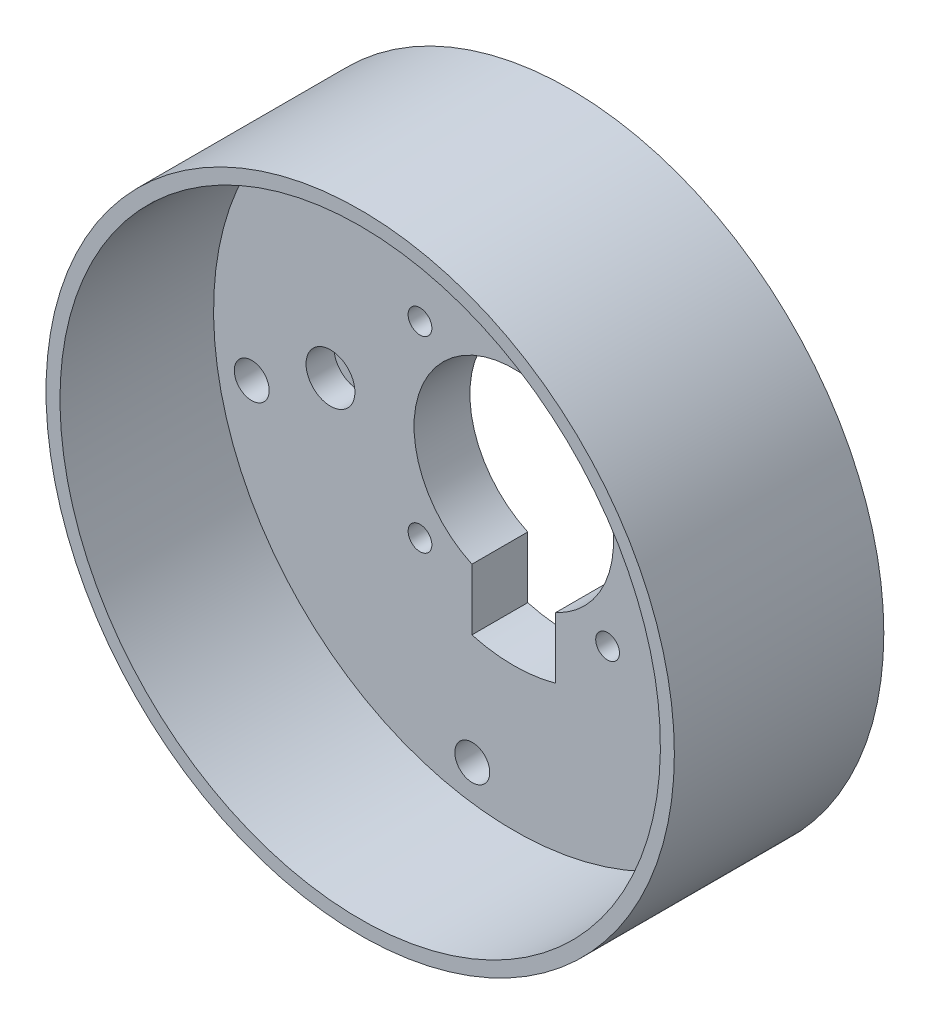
ISO-10303-21;
HEADER;
FILE_DESCRIPTION(('STEP AP214'),'2;1');
FILE_NAME('part.step','',(''),(''),'','','');
FILE_SCHEMA(('AUTOMOTIVE_DESIGN { 1 0 10303 214 1 1 1 1 }'));
ENDSEC;
DATA;
#1=APPLICATION_CONTEXT('core data for automotive mechanical design processes');
#2=APPLICATION_PROTOCOL_DEFINITION('international standard','automotive_design',2000,#1);
#3=PRODUCT_CONTEXT('',#1,'mechanical');
#4=PRODUCT('Part','Part','',(#3));
#5=PRODUCT_RELATED_PRODUCT_CATEGORY('part','',(#4));
#6=PRODUCT_DEFINITION_FORMATION('','',#4);
#7=PRODUCT_DEFINITION_CONTEXT('part definition',#1,'design');
#8=PRODUCT_DEFINITION('design','',#6,#7);
#9=PRODUCT_DEFINITION_SHAPE('','',#8);
#10=(LENGTH_UNIT() NAMED_UNIT(*) SI_UNIT(.MILLI.,.METRE.));
#11=(NAMED_UNIT(*) PLANE_ANGLE_UNIT() SI_UNIT($,.RADIAN.));
#12=(NAMED_UNIT(*) SI_UNIT($,.STERADIAN.) SOLID_ANGLE_UNIT());
#13=UNCERTAINTY_MEASURE_WITH_UNIT(LENGTH_MEASURE(1.E-05),#10,'distance_accuracy_value','');
#14=(GEOMETRIC_REPRESENTATION_CONTEXT(3) GLOBAL_UNCERTAINTY_ASSIGNED_CONTEXT((#13)) GLOBAL_UNIT_ASSIGNED_CONTEXT((#10,
#11,#12)) REPRESENTATION_CONTEXT('',''));
#15=CARTESIAN_POINT('',(0.,0.,0.));
#16=DIRECTION('',(0.,0.,1.));
#17=DIRECTION('',(1.,0.,0.));
#18=AXIS2_PLACEMENT_3D('',#15,#16,#17);
#19=CARTESIAN_POINT('',(0.,0.,8.));
#20=DIRECTION('',(0.,0.,1.));
#21=DIRECTION('',(1.,0.,0.));
#22=AXIS2_PLACEMENT_3D('',#19,#20,#21);
#23=PLANE('',#22);
#24=CARTESIAN_POINT('',(33.8582479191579,-17.251638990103,8.));
#25=DIRECTION('',(0.,0.,-1.));
#26=DIRECTION('',(-1.,0.,0.));
#27=AXIS2_PLACEMENT_3D('',#24,#25,#26);
#28=CIRCLE('',#27,2.5);
#29=CARTESIAN_POINT('',(31.3582479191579,-17.251638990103,8.));
#30=VERTEX_POINT('',#29);
#31=EDGE_CURVE('E216',#30,#30,#28,.T.);
#32=ORIENTED_EDGE('',*,*,#31,.T.);
#33=EDGE_LOOP('',(#32));
#34=FACE_BOUND('',#33,.T.);
#35=CARTESIAN_POINT('',(26.8700576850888,26.8700576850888,8.));
#36=DIRECTION('',(0.,0.,-1.));
#37=DIRECTION('',(-1.,0.,0.));
#38=AXIS2_PLACEMENT_3D('',#35,#36,#37);
#39=CIRCLE('',#38,2.5);
#40=CARTESIAN_POINT('',(24.3700576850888,26.8700576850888,8.));
#41=VERTEX_POINT('',#40);
#42=EDGE_CURVE('E201',#41,#41,#39,.T.);
#43=ORIENTED_EDGE('',*,*,#42,.T.);
#44=EDGE_LOOP('',(#43));
#45=FACE_BOUND('',#44,.T.);
#46=CARTESIAN_POINT('',(-5.94450967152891,-37.5321569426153,8.));
#47=DIRECTION('',(0.,0.,-1.));
#48=DIRECTION('',(-1.,0.,0.));
#49=AXIS2_PLACEMENT_3D('',#46,#47,#48);
#50=CIRCLE('',#49,2.5);
#51=CARTESIAN_POINT('',(-8.44450967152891,-37.5321569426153,8.));
#52=VERTEX_POINT('',#51);
#53=EDGE_CURVE('E197',#52,#52,#50,.T.);
#54=ORIENTED_EDGE('',*,*,#53,.T.);
#55=EDGE_LOOP('',(#54));
#56=FACE_BOUND('',#55,.T.);
#57=CARTESIAN_POINT('',(-17.2516389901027,33.8582479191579,8.));
#58=DIRECTION('',(0.,0.,-1.));
#59=DIRECTION('',(-1.,0.,0.));
#60=AXIS2_PLACEMENT_3D('',#57,#58,#59);
#61=CIRCLE('',#60,2.5);
#62=CARTESIAN_POINT('',(-19.7516389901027,33.8582479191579,8.));
#63=VERTEX_POINT('',#62);
#64=EDGE_CURVE('E193',#63,#63,#61,.T.);
#65=ORIENTED_EDGE('',*,*,#64,.T.);
#66=EDGE_LOOP('',(#65));
#67=FACE_BOUND('',#66,.T.);
#68=CARTESIAN_POINT('',(-37.5321569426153,-5.94450967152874,8.));
#69=DIRECTION('',(0.,0.,-1.));
#70=DIRECTION('',(-1.,0.,0.));
#71=AXIS2_PLACEMENT_3D('',#68,#69,#70);
#72=CIRCLE('',#71,2.5);
#73=CARTESIAN_POINT('',(-40.0321569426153,-5.94450967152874,8.));
#74=VERTEX_POINT('',#73);
#75=EDGE_CURVE('E188',#74,#74,#72,.T.);
#76=ORIENTED_EDGE('',*,*,#75,.T.);
#77=EDGE_LOOP('',(#76));
#78=FACE_BOUND('',#77,.T.);
#79=CARTESIAN_POINT('',(26.25,-1.72017955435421E-13,8.));
#80=DIRECTION('',(0.,0.,-1.));
#81=DIRECTION('',(-1.,0.,0.));
#82=AXIS2_PLACEMENT_3D('',#79,#80,#81);
#83=CIRCLE('',#82,3.5);
#84=CARTESIAN_POINT('',(22.75,-1.72017955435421E-13,8.));
#85=VERTEX_POINT('',#84);
#86=EDGE_CURVE('E187',#85,#85,#83,.T.);
#87=ORIENTED_EDGE('',*,*,#86,.T.);
#88=EDGE_LOOP('',(#87));
#89=FACE_BOUND('',#88,.T.);
#90=CARTESIAN_POINT('',(1.57918123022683E-13,26.2499999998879,8.));
#91=DIRECTION('',(0.,0.,-1.));
#92=DIRECTION('',(-1.,0.,0.));
#93=AXIS2_PLACEMENT_3D('',#90,#91,#92);
#94=CIRCLE('',#93,3.5);
#95=CARTESIAN_POINT('',(-3.49999999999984,26.2499999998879,8.));
#96=VERTEX_POINT('',#95);
#97=EDGE_CURVE('E181',#96,#96,#94,.T.);
#98=ORIENTED_EDGE('',*,*,#97,.T.);
#99=EDGE_LOOP('',(#98));
#100=FACE_BOUND('',#99,.T.);
#101=CARTESIAN_POINT('',(-26.2499999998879,1.26898491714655E-13,8.));
#102=DIRECTION('',(0.,0.,-1.));
#103=DIRECTION('',(-1.,0.,0.));
#104=AXIS2_PLACEMENT_3D('',#101,#102,#103);
#105=CIRCLE('',#104,3.5);
#106=CARTESIAN_POINT('',(-29.7499999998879,1.26898491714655E-13,8.));
#107=VERTEX_POINT('',#106);
#108=EDGE_CURVE('E175',#107,#107,#105,.T.);
#109=ORIENTED_EDGE('',*,*,#108,.T.);
#110=EDGE_LOOP('',(#109));
#111=FACE_BOUND('',#110,.T.);
#112=CARTESIAN_POINT('',(0.,0.,8.));
#113=DIRECTION('',(0.,0.,1.));
#114=DIRECTION('',(1.,0.,0.));
#115=AXIS2_PLACEMENT_3D('',#112,#113,#114);
#116=CIRCLE('',#115,22.55);
#117=CARTESIAN_POINT('',(6.,-21.7371226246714,8.));
#118=VERTEX_POINT('',#117);
#119=CARTESIAN_POINT('',(-6.,-21.7371226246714,8.));
#120=VERTEX_POINT('',#119);
#121=EDGE_CURVE('E70',#118,#120,#116,.F.);
#122=ORIENTED_EDGE('',*,*,#121,.T.);
#123=DIRECTION('',(0.,1.,0.));
#124=VECTOR('',#123,1.);
#125=CARTESIAN_POINT('',(-6.00000000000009,-15.2728456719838,8.));
#126=LINE('',#125,#124);
#127=CARTESIAN_POINT('',(-6.,-12.96659771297,8.));
#128=VERTEX_POINT('',#127);
#129=EDGE_CURVE('E62',#120,#128,#126,.T.);
#130=ORIENTED_EDGE('',*,*,#129,.T.);
#131=CARTESIAN_POINT('',(0.,0.,8.));
#132=DIRECTION('',(0.,0.,1.));
#133=DIRECTION('',(1.,0.,0.));
#134=AXIS2_PLACEMENT_3D('',#131,#132,#133);
#135=CIRCLE('',#134,14.2875);
#136=CARTESIAN_POINT('',(5.99999999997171,-12.9665977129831,8.));
#137=VERTEX_POINT('',#136);
#138=EDGE_CURVE('E11',#137,#128,#135,.T.);
#139=ORIENTED_EDGE('',*,*,#138,.F.);
#140=DIRECTION('',(0.,-1.,0.));
#141=VECTOR('',#140,1.);
#142=CARTESIAN_POINT('',(6.,-15.272845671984,8.));
#143=LINE('',#142,#141);
#144=EDGE_CURVE('E78',#137,#118,#143,.T.);
#145=ORIENTED_EDGE('',*,*,#144,.T.);
#146=EDGE_LOOP('',(#122,#130,#139,#145));
#147=FACE_BOUND('',#146,.T.);
#148=CARTESIAN_POINT('',(-13.4350288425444,-13.4350288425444,8.));
#149=DIRECTION('',(0.,0.,1.));
#150=DIRECTION('',(1.,0.,0.));
#151=AXIS2_PLACEMENT_3D('',#148,#149,#150);
#152=CIRCLE('',#151,1.7);
#153=CARTESIAN_POINT('',(-11.7350288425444,-13.4350288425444,8.));
#154=VERTEX_POINT('',#153);
#155=EDGE_CURVE('E145',#154,#154,#152,.T.);
#156=ORIENTED_EDGE('',*,*,#155,.F.);
#157=EDGE_LOOP('',(#156));
#158=FACE_BOUND('',#157,.T.);
#159=CARTESIAN_POINT('',(-13.4350288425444,13.4350288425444,8.));
#160=DIRECTION('',(0.,0.,1.));
#161=DIRECTION('',(1.,0.,0.));
#162=AXIS2_PLACEMENT_3D('',#159,#160,#161);
#163=CIRCLE('',#162,1.7);
#164=CARTESIAN_POINT('',(-11.7350288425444,13.4350288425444,8.));
#165=VERTEX_POINT('',#164);
#166=EDGE_CURVE('E133',#165,#165,#163,.T.);
#167=ORIENTED_EDGE('',*,*,#166,.F.);
#168=EDGE_LOOP('',(#167));
#169=FACE_BOUND('',#168,.T.);
#170=CARTESIAN_POINT('',(13.4350288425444,-13.4350288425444,8.));
#171=DIRECTION('',(0.,0.,1.));
#172=DIRECTION('',(1.,0.,0.));
#173=AXIS2_PLACEMENT_3D('',#170,#171,#172);
#174=CIRCLE('',#173,1.7);
#175=CARTESIAN_POINT('',(15.1350288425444,-13.4350288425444,8.));
#176=VERTEX_POINT('',#175);
#177=EDGE_CURVE('E120',#176,#176,#174,.T.);
#178=ORIENTED_EDGE('',*,*,#177,.F.);
#179=EDGE_LOOP('',(#178));
#180=FACE_BOUND('',#179,.T.);
#181=CARTESIAN_POINT('',(13.4350288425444,13.4350288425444,8.));
#182=DIRECTION('',(0.,0.,1.));
#183=DIRECTION('',(1.,0.,0.));
#184=AXIS2_PLACEMENT_3D('',#181,#182,#183);
#185=CIRCLE('',#184,1.7);
#186=CARTESIAN_POINT('',(15.1350288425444,13.4350288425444,8.));
#187=VERTEX_POINT('',#186);
#188=EDGE_CURVE('E107',#187,#187,#185,.T.);
#189=ORIENTED_EDGE('',*,*,#188,.F.);
#190=EDGE_LOOP('',(#189));
#191=FACE_BOUND('',#190,.T.);
#192=CARTESIAN_POINT('',(0.,0.,8.));
#193=DIRECTION('',(0.,0.,1.));
#194=DIRECTION('',(0.,1.,0.));
#195=AXIS2_PLACEMENT_3D('',#192,#193,#194);
#196=CIRCLE('',#195,43.);
#197=CARTESIAN_POINT('',(0.,43.,8.));
#198=VERTEX_POINT('',#197);
#199=EDGE_CURVE('E169',#198,#198,#196,.T.);
#200=ORIENTED_EDGE('',*,*,#199,.T.);
#201=EDGE_LOOP('',(#200));
#202=FACE_BOUND('',#201,.T.);
#203=ADVANCED_FACE('F17',(#34,#45,#56,#67,#78,#89,#100,#111,#147,#158,#169,#180,#191,#202),#23,.T.);
#204=CARTESIAN_POINT('',(0.,0.,0.));
#205=DIRECTION('',(0.,0.,1.));
#206=DIRECTION('',(1.,0.,0.));
#207=AXIS2_PLACEMENT_3D('',#204,#205,#206);
#208=PLANE('',#207);
#209=CARTESIAN_POINT('',(33.8582479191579,-17.251638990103,0.));
#210=DIRECTION('',(0.,0.,1.));
#211=DIRECTION('',(1.,0.,0.));
#212=AXIS2_PLACEMENT_3D('',#209,#210,#211);
#213=CIRCLE('',#212,2.5);
#214=CARTESIAN_POINT('',(36.3582479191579,-17.251638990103,0.));
#215=VERTEX_POINT('',#214);
#216=EDGE_CURVE('E21',#215,#215,#213,.T.);
#217=ORIENTED_EDGE('',*,*,#216,.T.);
#218=EDGE_LOOP('',(#217));
#219=FACE_BOUND('',#218,.T.);
#220=CARTESIAN_POINT('',(26.8700576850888,26.8700576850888,0.));
#221=DIRECTION('',(0.,0.,1.));
#222=DIRECTION('',(1.,0.,0.));
#223=AXIS2_PLACEMENT_3D('',#220,#221,#222);
#224=CIRCLE('',#223,2.5);
#225=CARTESIAN_POINT('',(29.3700576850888,26.8700576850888,0.));
#226=VERTEX_POINT('',#225);
#227=EDGE_CURVE('E198',#226,#226,#224,.T.);
#228=ORIENTED_EDGE('',*,*,#227,.T.);
#229=EDGE_LOOP('',(#228));
#230=FACE_BOUND('',#229,.T.);
#231=CARTESIAN_POINT('',(-5.94450967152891,-37.5321569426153,0.));
#232=DIRECTION('',(0.,0.,1.));
#233=DIRECTION('',(1.,0.,0.));
#234=AXIS2_PLACEMENT_3D('',#231,#232,#233);
#235=CIRCLE('',#234,2.5);
#236=CARTESIAN_POINT('',(-3.44450967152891,-37.5321569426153,0.));
#237=VERTEX_POINT('',#236);
#238=EDGE_CURVE('E194',#237,#237,#235,.T.);
#239=ORIENTED_EDGE('',*,*,#238,.T.);
#240=EDGE_LOOP('',(#239));
#241=FACE_BOUND('',#240,.T.);
#242=CARTESIAN_POINT('',(-17.2516389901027,33.8582479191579,0.));
#243=DIRECTION('',(0.,0.,1.));
#244=DIRECTION('',(1.,0.,0.));
#245=AXIS2_PLACEMENT_3D('',#242,#243,#244);
#246=CIRCLE('',#245,2.5);
#247=CARTESIAN_POINT('',(-14.7516389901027,33.8582479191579,0.));
#248=VERTEX_POINT('',#247);
#249=EDGE_CURVE('E189',#248,#248,#246,.T.);
#250=ORIENTED_EDGE('',*,*,#249,.T.);
#251=EDGE_LOOP('',(#250));
#252=FACE_BOUND('',#251,.T.);
#253=CARTESIAN_POINT('',(-37.5321569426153,-5.94450967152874,0.));
#254=DIRECTION('',(0.,0.,1.));
#255=DIRECTION('',(1.,0.,0.));
#256=AXIS2_PLACEMENT_3D('',#253,#254,#255);
#257=CIRCLE('',#256,2.5);
#258=CARTESIAN_POINT('',(-35.0321569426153,-5.94450967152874,0.));
#259=VERTEX_POINT('',#258);
#260=EDGE_CURVE('E183',#259,#259,#257,.T.);
#261=ORIENTED_EDGE('',*,*,#260,.T.);
#262=EDGE_LOOP('',(#261));
#263=FACE_BOUND('',#262,.T.);
#264=CARTESIAN_POINT('',(26.25,-1.72017955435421E-13,0.));
#265=DIRECTION('',(0.,0.,1.));
#266=DIRECTION('',(1.,0.,0.));
#267=AXIS2_PLACEMENT_3D('',#264,#265,#266);
#268=CIRCLE('',#267,1.7);
#269=CARTESIAN_POINT('',(27.95,-1.72017955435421E-13,0.));
#270=VERTEX_POINT('',#269);
#271=EDGE_CURVE('E177',#270,#270,#268,.T.);
#272=ORIENTED_EDGE('',*,*,#271,.T.);
#273=EDGE_LOOP('',(#272));
#274=FACE_BOUND('',#273,.T.);
#275=CARTESIAN_POINT('',(1.57918123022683E-13,26.2499999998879,0.));
#276=DIRECTION('',(0.,0.,1.));
#277=DIRECTION('',(1.,0.,0.));
#278=AXIS2_PLACEMENT_3D('',#275,#276,#277);
#279=CIRCLE('',#278,1.7);
#280=CARTESIAN_POINT('',(1.70000000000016,26.2499999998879,0.));
#281=VERTEX_POINT('',#280);
#282=EDGE_CURVE('E171',#281,#281,#279,.T.);
#283=ORIENTED_EDGE('',*,*,#282,.T.);
#284=EDGE_LOOP('',(#283));
#285=FACE_BOUND('',#284,.T.);
#286=CARTESIAN_POINT('',(-26.2499999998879,1.26898491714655E-13,0.));
#287=DIRECTION('',(0.,0.,1.));
#288=DIRECTION('',(1.,0.,0.));
#289=AXIS2_PLACEMENT_3D('',#286,#287,#288);
#290=CIRCLE('',#289,1.7);
#291=CARTESIAN_POINT('',(-24.5499999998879,1.26898491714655E-13,0.));
#292=VERTEX_POINT('',#291);
#293=EDGE_CURVE('E165',#292,#292,#290,.T.);
#294=ORIENTED_EDGE('',*,*,#293,.T.);
#295=EDGE_LOOP('',(#294));
#296=FACE_BOUND('',#295,.T.);
#297=CARTESIAN_POINT('',(0.,0.,0.));
#298=DIRECTION('',(0.,0.,1.));
#299=DIRECTION('',(1.,0.,0.));
#300=AXIS2_PLACEMENT_3D('',#297,#298,#299);
#301=CIRCLE('',#300,45.);
#302=CARTESIAN_POINT('',(45.,0.,0.));
#303=VERTEX_POINT('',#302);
#304=EDGE_CURVE('E147',#303,#303,#301,.T.);
#305=ORIENTED_EDGE('',*,*,#304,.F.);
#306=EDGE_LOOP('',(#305));
#307=FACE_BOUND('',#306,.T.);
#308=CARTESIAN_POINT('',(-13.4350288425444,-13.4350288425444,0.));
#309=DIRECTION('',(0.,0.,1.));
#310=DIRECTION('',(1.,0.,0.));
#311=AXIS2_PLACEMENT_3D('',#308,#309,#310);
#312=CIRCLE('',#311,3.5);
#313=CARTESIAN_POINT('',(-9.9350288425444,-13.4350288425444,0.));
#314=VERTEX_POINT('',#313);
#315=EDGE_CURVE('E134',#314,#314,#312,.T.);
#316=ORIENTED_EDGE('',*,*,#315,.T.);
#317=EDGE_LOOP('',(#316));
#318=FACE_BOUND('',#317,.T.);
#319=CARTESIAN_POINT('',(-13.4350288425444,13.4350288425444,0.));
#320=DIRECTION('',(0.,0.,1.));
#321=DIRECTION('',(1.,0.,0.));
#322=AXIS2_PLACEMENT_3D('',#319,#320,#321);
#323=CIRCLE('',#322,3.5);
#324=CARTESIAN_POINT('',(-9.9350288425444,13.4350288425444,0.));
#325=VERTEX_POINT('',#324);
#326=EDGE_CURVE('E121',#325,#325,#323,.T.);
#327=ORIENTED_EDGE('',*,*,#326,.T.);
#328=EDGE_LOOP('',(#327));
#329=FACE_BOUND('',#328,.T.);
#330=CARTESIAN_POINT('',(13.4350288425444,-13.4350288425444,0.));
#331=DIRECTION('',(0.,0.,1.));
#332=DIRECTION('',(1.,0.,0.));
#333=AXIS2_PLACEMENT_3D('',#330,#331,#332);
#334=CIRCLE('',#333,3.5);
#335=CARTESIAN_POINT('',(16.9350288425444,-13.4350288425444,0.));
#336=VERTEX_POINT('',#335);
#337=EDGE_CURVE('E108',#336,#336,#334,.T.);
#338=ORIENTED_EDGE('',*,*,#337,.T.);
#339=EDGE_LOOP('',(#338));
#340=FACE_BOUND('',#339,.T.);
#341=CARTESIAN_POINT('',(13.4350288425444,13.4350288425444,0.));
#342=DIRECTION('',(0.,0.,1.));
#343=DIRECTION('',(1.,0.,0.));
#344=AXIS2_PLACEMENT_3D('',#341,#342,#343);
#345=CIRCLE('',#344,3.5);
#346=CARTESIAN_POINT('',(16.9350288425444,13.4350288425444,0.));
#347=VERTEX_POINT('',#346);
#348=EDGE_CURVE('E95',#347,#347,#345,.T.);
#349=ORIENTED_EDGE('',*,*,#348,.T.);
#350=EDGE_LOOP('',(#349));
#351=FACE_BOUND('',#350,.T.);
#352=DIRECTION('',(0.,-1.,0.));
#353=VECTOR('',#352,1.);
#354=CARTESIAN_POINT('',(6.,-12.96659771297,0.));
#355=LINE('',#354,#353);
#356=CARTESIAN_POINT('',(5.99999999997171,-12.9665977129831,0.));
#357=VERTEX_POINT('',#356);
#358=CARTESIAN_POINT('',(6.,-21.7371226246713,0.));
#359=VERTEX_POINT('',#358);
#360=EDGE_CURVE('E279',#357,#359,#355,.T.);
#361=ORIENTED_EDGE('',*,*,#360,.F.);
#362=CARTESIAN_POINT('',(0.,0.,0.));
#363=DIRECTION('',(0.,0.,1.));
#364=DIRECTION('',(1.,0.,0.));
#365=AXIS2_PLACEMENT_3D('',#362,#363,#364);
#366=CIRCLE('',#365,14.2875);
#367=CARTESIAN_POINT('',(-6.,-12.96659771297,0.));
#368=VERTEX_POINT('',#367);
#369=EDGE_CURVE('E27',#357,#368,#366,.T.);
#370=ORIENTED_EDGE('',*,*,#369,.T.);
#371=DIRECTION('',(0.,1.,0.));
#372=VECTOR('',#371,1.);
#373=CARTESIAN_POINT('',(-6.,-21.7371226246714,0.));
#374=LINE('',#373,#372);
#375=CARTESIAN_POINT('',(-6.,-21.7371226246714,0.));
#376=VERTEX_POINT('',#375);
#377=EDGE_CURVE('E64',#376,#368,#374,.T.);
#378=ORIENTED_EDGE('',*,*,#377,.F.);
#379=CARTESIAN_POINT('',(0.,0.,0.));
#380=DIRECTION('',(0.,0.,-1.));
#381=DIRECTION('',(-1.,0.,0.));
#382=AXIS2_PLACEMENT_3D('',#379,#380,#381);
#383=CIRCLE('',#382,22.55);
#384=EDGE_CURVE('E94',#359,#376,#383,.T.);
#385=ORIENTED_EDGE('',*,*,#384,.F.);
#386=EDGE_LOOP('',(#361,#370,#378,#385));
#387=FACE_BOUND('',#386,.T.);
#388=ADVANCED_FACE('F291',(#219,#230,#241,#252,#263,#274,#285,#296,#307,#318,#329,#340,#351,
#387),#208,.F.);
#389=CARTESIAN_POINT('',(0.,0.,8.));
#390=DIRECTION('',(0.,0.,-1.));
#391=DIRECTION('',(-1.,0.,0.));
#392=AXIS2_PLACEMENT_3D('',#389,#390,#391);
#393=CYLINDRICAL_SURFACE('',#392,45.);
#394=ORIENTED_EDGE('',*,*,#304,.T.);
#395=EDGE_LOOP('',(#394));
#396=FACE_BOUND('',#395,.T.);
#397=CARTESIAN_POINT('',(0.,0.,30.));
#398=DIRECTION('',(0.,0.,-1.));
#399=DIRECTION('',(1.,0.,0.));
#400=AXIS2_PLACEMENT_3D('',#397,#398,#399);
#401=CIRCLE('',#400,45.);
#402=CARTESIAN_POINT('',(45.,0.,30.));
#403=VERTEX_POINT('',#402);
#404=EDGE_CURVE('E267',#403,#403,#401,.T.);
#405=ORIENTED_EDGE('',*,*,#404,.T.);
#406=EDGE_LOOP('',(#405));
#407=FACE_BOUND('',#406,.T.);
#408=ADVANCED_FACE('F19',(#396,#407),#393,.T.);
#409=CARTESIAN_POINT('',(0.,0.,8.));
#410=DIRECTION('',(0.,0.,-1.));
#411=DIRECTION('',(-1.,0.,0.));
#412=AXIS2_PLACEMENT_3D('',#409,#410,#411);
#413=CYLINDRICAL_SURFACE('',#412,14.2875);
#414=DIRECTION('',(0.,0.,-1.));
#415=VECTOR('',#414,1.);
#416=CARTESIAN_POINT('',(5.99999999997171,-12.9665977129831,8.8));
#417=LINE('',#416,#415);
#418=EDGE_CURVE('E69',#137,#357,#417,.T.);
#419=ORIENTED_EDGE('',*,*,#418,.F.);
#420=ORIENTED_EDGE('',*,*,#138,.T.);
#421=DIRECTION('',(0.,0.,-1.));
#422=VECTOR('',#421,1.);
#423=CARTESIAN_POINT('',(-6.,-12.96659771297,8.8));
#424=LINE('',#423,#422);
#425=EDGE_CURVE('E59',#128,#368,#424,.T.);
#426=ORIENTED_EDGE('',*,*,#425,.T.);
#427=ORIENTED_EDGE('',*,*,#369,.F.);
#428=EDGE_LOOP('',(#419,#420,#426,#427));
#429=FACE_BOUND('',#428,.T.);
#430=ADVANCED_FACE('F82',(#429),#413,.F.);
#431=CARTESIAN_POINT('',(-13.4350288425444,-13.4350288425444,71.5193305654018));
#432=DIRECTION('',(0.,0.,1.));
#433=DIRECTION('',(1.,0.,0.));
#434=AXIS2_PLACEMENT_3D('',#431,#432,#433);
#435=CYLINDRICAL_SURFACE('',#434,1.7);
#436=ORIENTED_EDGE('',*,*,#155,.T.);
#437=EDGE_LOOP('',(#436));
#438=FACE_BOUND('',#437,.T.);
#439=CARTESIAN_POINT('',(-13.4350288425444,-13.4350288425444,2.5));
#440=DIRECTION('',(0.,0.,1.));
#441=DIRECTION('',(1.,0.,0.));
#442=AXIS2_PLACEMENT_3D('',#439,#440,#441);
#443=CIRCLE('',#442,1.7);
#444=CARTESIAN_POINT('',(-11.7350288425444,-13.4350288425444,2.5));
#445=VERTEX_POINT('',#444);
#446=EDGE_CURVE('E142',#445,#445,#443,.F.);
#447=ORIENTED_EDGE('',*,*,#446,.T.);
#448=EDGE_LOOP('',(#447));
#449=FACE_BOUND('',#448,.T.);
#450=ADVANCED_FACE('F320',(#438,#449),#435,.F.);
#451=CARTESIAN_POINT('',(-13.4350288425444,-13.4350288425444,2.5));
#452=DIRECTION('',(0.,0.,1.));
#453=DIRECTION('',(1.,0.,0.));
#454=AXIS2_PLACEMENT_3D('',#451,#452,#453);
#455=PLANE('',#454);
#456=ORIENTED_EDGE('',*,*,#446,.F.);
#457=EDGE_LOOP('',(#456));
#458=FACE_BOUND('',#457,.T.);
#459=CARTESIAN_POINT('',(-13.4350288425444,-13.4350288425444,2.5));
#460=DIRECTION('',(0.,0.,1.));
#461=DIRECTION('',(1.,0.,0.));
#462=AXIS2_PLACEMENT_3D('',#459,#460,#461);
#463=CIRCLE('',#462,3.5);
#464=CARTESIAN_POINT('',(-9.9350288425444,-13.4350288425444,2.5));
#465=VERTEX_POINT('',#464);
#466=EDGE_CURVE('E138',#465,#465,#463,.F.);
#467=ORIENTED_EDGE('',*,*,#466,.T.);
#468=EDGE_LOOP('',(#467));
#469=FACE_BOUND('',#468,.T.);
#470=ADVANCED_FACE('F325',(#458,#469),#455,.F.);
#471=CARTESIAN_POINT('',(-13.4350288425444,-13.4350288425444,0.));
#472=DIRECTION('',(0.,0.,1.));
#473=DIRECTION('',(1.,0.,0.));
#474=AXIS2_PLACEMENT_3D('',#471,#472,#473);
#475=CYLINDRICAL_SURFACE('',#474,3.5);
#476=ORIENTED_EDGE('',*,*,#466,.F.);
#477=EDGE_LOOP('',(#476));
#478=FACE_BOUND('',#477,.T.);
#479=ORIENTED_EDGE('',*,*,#315,.F.);
#480=EDGE_LOOP('',(#479));
#481=FACE_BOUND('',#480,.T.);
#482=ADVANCED_FACE('F317',(#478,#481),#475,.F.);
#483=CARTESIAN_POINT('',(-13.4350288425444,13.4350288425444,71.5193305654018));
#484=DIRECTION('',(0.,0.,1.));
#485=DIRECTION('',(1.,0.,0.));
#486=AXIS2_PLACEMENT_3D('',#483,#484,#485);
#487=CYLINDRICAL_SURFACE('',#486,1.7);
#488=ORIENTED_EDGE('',*,*,#166,.T.);
#489=EDGE_LOOP('',(#488));
#490=FACE_BOUND('',#489,.T.);
#491=CARTESIAN_POINT('',(-13.4350288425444,13.4350288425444,2.5));
#492=DIRECTION('',(0.,0.,1.));
#493=DIRECTION('',(1.,0.,0.));
#494=AXIS2_PLACEMENT_3D('',#491,#492,#493);
#495=CIRCLE('',#494,1.7);
#496=CARTESIAN_POINT('',(-11.7350288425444,13.4350288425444,2.5));
#497=VERTEX_POINT('',#496);
#498=EDGE_CURVE('E129',#497,#497,#495,.F.);
#499=ORIENTED_EDGE('',*,*,#498,.T.);
#500=EDGE_LOOP('',(#499));
#501=FACE_BOUND('',#500,.T.);
#502=ADVANCED_FACE('F383',(#490,#501),#487,.F.);
#503=CARTESIAN_POINT('',(-13.4350288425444,13.4350288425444,2.5));
#504=DIRECTION('',(0.,0.,1.));
#505=DIRECTION('',(1.,0.,0.));
#506=AXIS2_PLACEMENT_3D('',#503,#504,#505);
#507=PLANE('',#506);
#508=ORIENTED_EDGE('',*,*,#498,.F.);
#509=EDGE_LOOP('',(#508));
#510=FACE_BOUND('',#509,.T.);
#511=CARTESIAN_POINT('',(-13.4350288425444,13.4350288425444,2.5));
#512=DIRECTION('',(0.,0.,1.));
#513=DIRECTION('',(1.,0.,0.));
#514=AXIS2_PLACEMENT_3D('',#511,#512,#513);
#515=CIRCLE('',#514,3.5);
#516=CARTESIAN_POINT('',(-9.9350288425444,13.4350288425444,2.5));
#517=VERTEX_POINT('',#516);
#518=EDGE_CURVE('E125',#517,#517,#515,.F.);
#519=ORIENTED_EDGE('',*,*,#518,.T.);
#520=EDGE_LOOP('',(#519));
#521=FACE_BOUND('',#520,.T.);
#522=ADVANCED_FACE('F386',(#510,#521),#507,.F.);
#523=CARTESIAN_POINT('',(-13.4350288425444,13.4350288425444,0.));
#524=DIRECTION('',(0.,0.,1.));
#525=DIRECTION('',(1.,0.,0.));
#526=AXIS2_PLACEMENT_3D('',#523,#524,#525);
#527=CYLINDRICAL_SURFACE('',#526,3.5);
#528=ORIENTED_EDGE('',*,*,#518,.F.);
#529=EDGE_LOOP('',(#528));
#530=FACE_BOUND('',#529,.T.);
#531=ORIENTED_EDGE('',*,*,#326,.F.);
#532=EDGE_LOOP('',(#531));
#533=FACE_BOUND('',#532,.T.);
#534=ADVANCED_FACE('F374',(#530,#533),#527,.F.);
#535=CARTESIAN_POINT('',(13.4350288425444,-13.4350288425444,71.5193305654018));
#536=DIRECTION('',(0.,0.,1.));
#537=DIRECTION('',(1.,0.,0.));
#538=AXIS2_PLACEMENT_3D('',#535,#536,#537);
#539=CYLINDRICAL_SURFACE('',#538,1.7);
#540=ORIENTED_EDGE('',*,*,#177,.T.);
#541=EDGE_LOOP('',(#540));
#542=FACE_BOUND('',#541,.T.);
#543=CARTESIAN_POINT('',(13.4350288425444,-13.4350288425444,2.5));
#544=DIRECTION('',(0.,0.,1.));
#545=DIRECTION('',(1.,0.,0.));
#546=AXIS2_PLACEMENT_3D('',#543,#544,#545);
#547=CIRCLE('',#546,1.7);
#548=CARTESIAN_POINT('',(15.1350288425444,-13.4350288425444,2.5));
#549=VERTEX_POINT('',#548);
#550=EDGE_CURVE('E116',#549,#549,#547,.F.);
#551=ORIENTED_EDGE('',*,*,#550,.T.);
#552=EDGE_LOOP('',(#551));
#553=FACE_BOUND('',#552,.T.);
#554=ADVANCED_FACE('F370',(#542,#553),#539,.F.);
#555=CARTESIAN_POINT('',(13.4350288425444,-13.4350288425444,2.5));
#556=DIRECTION('',(0.,0.,1.));
#557=DIRECTION('',(1.,0.,0.));
#558=AXIS2_PLACEMENT_3D('',#555,#556,#557);
#559=PLANE('',#558);
#560=ORIENTED_EDGE('',*,*,#550,.F.);
#561=EDGE_LOOP('',(#560));
#562=FACE_BOUND('',#561,.T.);
#563=CARTESIAN_POINT('',(13.4350288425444,-13.4350288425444,2.5));
#564=DIRECTION('',(0.,0.,1.));
#565=DIRECTION('',(1.,0.,0.));
#566=AXIS2_PLACEMENT_3D('',#563,#564,#565);
#567=CIRCLE('',#566,3.5);
#568=CARTESIAN_POINT('',(16.9350288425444,-13.4350288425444,2.5));
#569=VERTEX_POINT('',#568);
#570=EDGE_CURVE('E112',#569,#569,#567,.F.);
#571=ORIENTED_EDGE('',*,*,#570,.T.);
#572=EDGE_LOOP('',(#571));
#573=FACE_BOUND('',#572,.T.);
#574=ADVANCED_FACE('F373',(#562,#573),#559,.F.);
#575=CARTESIAN_POINT('',(13.4350288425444,-13.4350288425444,0.));
#576=DIRECTION('',(0.,0.,1.));
#577=DIRECTION('',(1.,0.,0.));
#578=AXIS2_PLACEMENT_3D('',#575,#576,#577);
#579=CYLINDRICAL_SURFACE('',#578,3.5);
#580=ORIENTED_EDGE('',*,*,#570,.F.);
#581=EDGE_LOOP('',(#580));
#582=FACE_BOUND('',#581,.T.);
#583=ORIENTED_EDGE('',*,*,#337,.F.);
#584=EDGE_LOOP('',(#583));
#585=FACE_BOUND('',#584,.T.);
#586=ADVANCED_FACE('F378',(#582,#585),#579,.F.);
#587=CARTESIAN_POINT('',(13.4350288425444,13.4350288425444,71.5193305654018));
#588=DIRECTION('',(0.,0.,1.));
#589=DIRECTION('',(1.,0.,0.));
#590=AXIS2_PLACEMENT_3D('',#587,#588,#589);
#591=CYLINDRICAL_SURFACE('',#590,1.7);
#592=ORIENTED_EDGE('',*,*,#188,.T.);
#593=EDGE_LOOP('',(#592));
#594=FACE_BOUND('',#593,.T.);
#595=CARTESIAN_POINT('',(13.4350288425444,13.4350288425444,2.5));
#596=DIRECTION('',(0.,0.,1.));
#597=DIRECTION('',(1.,0.,0.));
#598=AXIS2_PLACEMENT_3D('',#595,#596,#597);
#599=CIRCLE('',#598,1.7);
#600=CARTESIAN_POINT('',(15.1350288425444,13.4350288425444,2.5));
#601=VERTEX_POINT('',#600);
#602=EDGE_CURVE('E103',#601,#601,#599,.F.);
#603=ORIENTED_EDGE('',*,*,#602,.T.);
#604=EDGE_LOOP('',(#603));
#605=FACE_BOUND('',#604,.T.);
#606=ADVANCED_FACE('F364',(#594,#605),#591,.F.);
#607=CARTESIAN_POINT('',(13.4350288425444,13.4350288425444,2.5));
#608=DIRECTION('',(0.,0.,1.));
#609=DIRECTION('',(1.,0.,0.));
#610=AXIS2_PLACEMENT_3D('',#607,#608,#609);
#611=PLANE('',#610);
#612=ORIENTED_EDGE('',*,*,#602,.F.);
#613=EDGE_LOOP('',(#612));
#614=FACE_BOUND('',#613,.T.);
#615=CARTESIAN_POINT('',(13.4350288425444,13.4350288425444,2.5));
#616=DIRECTION('',(0.,0.,1.));
#617=DIRECTION('',(1.,0.,0.));
#618=AXIS2_PLACEMENT_3D('',#615,#616,#617);
#619=CIRCLE('',#618,3.5);
#620=CARTESIAN_POINT('',(16.9350288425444,13.4350288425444,2.5));
#621=VERTEX_POINT('',#620);
#622=EDGE_CURVE('E99',#621,#621,#619,.F.);
#623=ORIENTED_EDGE('',*,*,#622,.T.);
#624=EDGE_LOOP('',(#623));
#625=FACE_BOUND('',#624,.T.);
#626=ADVANCED_FACE('F358',(#614,#625),#611,.F.);
#627=CARTESIAN_POINT('',(13.4350288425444,13.4350288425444,0.));
#628=DIRECTION('',(0.,0.,1.));
#629=DIRECTION('',(1.,0.,0.));
#630=AXIS2_PLACEMENT_3D('',#627,#628,#629);
#631=CYLINDRICAL_SURFACE('',#630,3.5);
#632=ORIENTED_EDGE('',*,*,#622,.F.);
#633=EDGE_LOOP('',(#632));
#634=FACE_BOUND('',#633,.T.);
#635=ORIENTED_EDGE('',*,*,#348,.F.);
#636=EDGE_LOOP('',(#635));
#637=FACE_BOUND('',#636,.T.);
#638=ADVANCED_FACE('F354',(#634,#637),#631,.F.);
#639=CARTESIAN_POINT('',(-6.,-21.7371226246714,8.8));
#640=DIRECTION('',(-1.,0.,0.));
#641=DIRECTION('',(0.,-1.,0.));
#642=AXIS2_PLACEMENT_3D('',#639,#640,#641);
#643=PLANE('',#642);
#644=DIRECTION('',(0.,0.,-1.));
#645=VECTOR('',#644,1.);
#646=CARTESIAN_POINT('',(-6.,-21.7371226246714,8.8));
#647=LINE('',#646,#645);
#648=EDGE_CURVE('E43',#376,#120,#647,.F.);
#649=ORIENTED_EDGE('',*,*,#648,.F.);
#650=ORIENTED_EDGE('',*,*,#377,.T.);
#651=ORIENTED_EDGE('',*,*,#425,.F.);
#652=ORIENTED_EDGE('',*,*,#129,.F.);
#653=EDGE_LOOP('',(#649,#650,#651,#652));
#654=FACE_BOUND('',#653,.T.);
#655=ADVANCED_FACE('F61',(#654),#643,.F.);
#656=CARTESIAN_POINT('',(6.,-12.96659771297,8.8));
#657=DIRECTION('',(1.,0.,0.));
#658=DIRECTION('',(0.,1.,0.));
#659=AXIS2_PLACEMENT_3D('',#656,#657,#658);
#660=PLANE('',#659);
#661=ORIENTED_EDGE('',*,*,#418,.T.);
#662=ORIENTED_EDGE('',*,*,#360,.T.);
#663=DIRECTION('',(0.,0.,-1.));
#664=VECTOR('',#663,1.);
#665=CARTESIAN_POINT('',(6.,-21.7371226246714,8.8));
#666=LINE('',#665,#664);
#667=EDGE_CURVE('E35',#359,#118,#666,.F.);
#668=ORIENTED_EDGE('',*,*,#667,.T.);
#669=ORIENTED_EDGE('',*,*,#144,.F.);
#670=EDGE_LOOP('',(#661,#662,#668,#669));
#671=FACE_BOUND('',#670,.T.);
#672=ADVANCED_FACE('F288',(#671),#660,.F.);
#673=CARTESIAN_POINT('',(0.,0.,8.8));
#674=DIRECTION('',(0.,0.,-1.));
#675=DIRECTION('',(-1.,0.,0.));
#676=AXIS2_PLACEMENT_3D('',#673,#674,#675);
#677=CYLINDRICAL_SURFACE('',#676,22.55);
#678=ORIENTED_EDGE('',*,*,#667,.F.);
#679=ORIENTED_EDGE('',*,*,#384,.T.);
#680=ORIENTED_EDGE('',*,*,#648,.T.);
#681=ORIENTED_EDGE('',*,*,#121,.F.);
#682=EDGE_LOOP('',(#678,#679,#680,#681));
#683=FACE_BOUND('',#682,.T.);
#684=ADVANCED_FACE('F292',(#683),#677,.F.);
#685=CARTESIAN_POINT('',(0.,0.,30.));
#686=DIRECTION('',(0.,0.,-1.));
#687=DIRECTION('',(-1.,0.,0.));
#688=AXIS2_PLACEMENT_3D('',#685,#686,#687);
#689=CYLINDRICAL_SURFACE('',#688,43.);
#690=CARTESIAN_POINT('',(0.,0.,30.));
#691=DIRECTION('',(0.,0.,1.));
#692=DIRECTION('',(0.,1.,0.));
#693=AXIS2_PLACEMENT_3D('',#690,#691,#692);
#694=CIRCLE('',#693,43.);
#695=CARTESIAN_POINT('',(0.,43.,30.));
#696=VERTEX_POINT('',#695);
#697=EDGE_CURVE('E79',#696,#696,#694,.T.);
#698=ORIENTED_EDGE('',*,*,#697,.T.);
#699=EDGE_LOOP('',(#698));
#700=FACE_BOUND('',#699,.T.);
#701=ORIENTED_EDGE('',*,*,#199,.F.);
#702=EDGE_LOOP('',(#701));
#703=FACE_BOUND('',#702,.T.);
#704=ADVANCED_FACE('F294',(#700,#703),#689,.F.);
#705=CARTESIAN_POINT('',(0.,0.,30.));
#706=DIRECTION('',(0.,0.,-1.));
#707=DIRECTION('',(-1.,0.,0.));
#708=AXIS2_PLACEMENT_3D('',#705,#706,#707);
#709=PLANE('',#708);
#710=ORIENTED_EDGE('',*,*,#404,.F.);
#711=EDGE_LOOP('',(#710));
#712=FACE_BOUND('',#711,.T.);
#713=ORIENTED_EDGE('',*,*,#697,.F.);
#714=EDGE_LOOP('',(#713));
#715=FACE_BOUND('',#714,.T.);
#716=ADVANCED_FACE('F301',(#712,#715),#709,.F.);
#717=CARTESIAN_POINT('',(-26.2499999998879,1.26898491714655E-13,-51.9603427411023));
#718=DIRECTION('',(0.,0.,-1.));
#719=DIRECTION('',(-1.,0.,0.));
#720=AXIS2_PLACEMENT_3D('',#717,#718,#719);
#721=CYLINDRICAL_SURFACE('',#720,1.7);
#722=CARTESIAN_POINT('',(-26.2499999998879,1.26898491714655E-13,3.48038475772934));
#723=DIRECTION('',(0.,0.,-1.));
#724=DIRECTION('',(-1.,0.,0.));
#725=AXIS2_PLACEMENT_3D('',#722,#723,#724);
#726=CIRCLE('',#725,1.7);
#727=CARTESIAN_POINT('',(-27.9499999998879,1.26898491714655E-13,3.48038475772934));
#728=VERTEX_POINT('',#727);
#729=EDGE_CURVE('E260',#728,#728,#726,.F.);
#730=ORIENTED_EDGE('',*,*,#729,.T.);
#731=EDGE_LOOP('',(#730));
#732=FACE_BOUND('',#731,.T.);
#733=ORIENTED_EDGE('',*,*,#293,.F.);
#734=EDGE_LOOP('',(#733));
#735=FACE_BOUND('',#734,.T.);
#736=ADVANCED_FACE('F337',(#732,#735),#721,.F.);
#737=CARTESIAN_POINT('',(-26.2499999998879,1.26898491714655E-13,4.));
#738=DIRECTION('',(0.,0.,-1.));
#739=DIRECTION('',(-1.,0.,0.));
#740=AXIS2_PLACEMENT_3D('',#737,#738,#739);
#741=PLANE('',#740);
#742=CARTESIAN_POINT('',(-26.2499999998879,1.26898491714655E-13,4.));
#743=DIRECTION('',(0.,0.,-1.));
#744=DIRECTION('',(-1.,0.,0.));
#745=AXIS2_PLACEMENT_3D('',#742,#743,#744);
#746=CIRCLE('',#745,2.);
#747=CARTESIAN_POINT('',(-28.2499999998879,1.26898491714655E-13,4.));
#748=VERTEX_POINT('',#747);
#749=EDGE_CURVE('E170',#748,#748,#746,.T.);
#750=ORIENTED_EDGE('',*,*,#749,.T.);
#751=EDGE_LOOP('',(#750));
#752=FACE_BOUND('',#751,.T.);
#753=CARTESIAN_POINT('',(-26.2499999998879,1.26898491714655E-13,4.));
#754=DIRECTION('',(0.,0.,-1.));
#755=DIRECTION('',(-1.,0.,0.));
#756=AXIS2_PLACEMENT_3D('',#753,#754,#755);
#757=CIRCLE('',#756,3.5);
#758=CARTESIAN_POINT('',(-29.7499999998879,1.26898491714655E-13,4.));
#759=VERTEX_POINT('',#758);
#760=EDGE_CURVE('E256',#759,#759,#757,.F.);
#761=ORIENTED_EDGE('',*,*,#760,.T.);
#762=EDGE_LOOP('',(#761));
#763=FACE_BOUND('',#762,.T.);
#764=ADVANCED_FACE('F346',(#752,#763),#741,.F.);
#765=CARTESIAN_POINT('',(-26.2499999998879,1.26898491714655E-13,8.));
#766=DIRECTION('',(0.,0.,-1.));
#767=DIRECTION('',(-1.,0.,0.));
#768=AXIS2_PLACEMENT_3D('',#765,#766,#767);
#769=CYLINDRICAL_SURFACE('',#768,3.5);
#770=ORIENTED_EDGE('',*,*,#760,.F.);
#771=EDGE_LOOP('',(#770));
#772=FACE_BOUND('',#771,.T.);
#773=ORIENTED_EDGE('',*,*,#108,.F.);
#774=EDGE_LOOP('',(#773));
#775=FACE_BOUND('',#774,.T.);
#776=ADVANCED_FACE('F516',(#772,#775),#769,.F.);
#777=CARTESIAN_POINT('',(-26.2499999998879,1.26898491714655E-13,3.48038475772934));
#778=DIRECTION('',(0.,0.,1.));
#779=DIRECTION('',(1.,0.,0.));
#780=AXIS2_PLACEMENT_3D('',#777,#778,#779);
#781=CONICAL_SURFACE('',#780,1.7,0.523598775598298);
#782=ORIENTED_EDGE('',*,*,#749,.F.);
#783=EDGE_LOOP('',(#782));
#784=FACE_BOUND('',#783,.T.);
#785=ORIENTED_EDGE('',*,*,#729,.F.);
#786=EDGE_LOOP('',(#785));
#787=FACE_BOUND('',#786,.T.);
#788=ADVANCED_FACE('F351',(#784,#787),#781,.F.);
#789=CARTESIAN_POINT('',(1.57918123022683E-13,26.2499999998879,-51.9603427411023));
#790=DIRECTION('',(0.,0.,-1.));
#791=DIRECTION('',(-1.,0.,0.));
#792=AXIS2_PLACEMENT_3D('',#789,#790,#791);
#793=CYLINDRICAL_SURFACE('',#792,1.7);
#794=CARTESIAN_POINT('',(1.57918123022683E-13,26.2499999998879,3.48038475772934));
#795=DIRECTION('',(0.,0.,-1.));
#796=DIRECTION('',(-1.,0.,0.));
#797=AXIS2_PLACEMENT_3D('',#794,#795,#796);
#798=CIRCLE('',#797,1.7);
#799=CARTESIAN_POINT('',(-1.69999999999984,26.2499999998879,3.48038475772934));
#800=VERTEX_POINT('',#799);
#801=EDGE_CURVE('E246',#800,#800,#798,.F.);
#802=ORIENTED_EDGE('',*,*,#801,.T.);
#803=EDGE_LOOP('',(#802));
#804=FACE_BOUND('',#803,.T.);
#805=ORIENTED_EDGE('',*,*,#282,.F.);
#806=EDGE_LOOP('',(#805));
#807=FACE_BOUND('',#806,.T.);
#808=ADVANCED_FACE('F536',(#804,#807),#793,.F.);
#809=CARTESIAN_POINT('',(1.57918123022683E-13,26.2499999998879,4.));
#810=DIRECTION('',(0.,0.,-1.));
#811=DIRECTION('',(-1.,0.,0.));
#812=AXIS2_PLACEMENT_3D('',#809,#810,#811);
#813=PLANE('',#812);
#814=CARTESIAN_POINT('',(1.57918123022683E-13,26.2499999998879,4.));
#815=DIRECTION('',(0.,0.,-1.));
#816=DIRECTION('',(-1.,0.,0.));
#817=AXIS2_PLACEMENT_3D('',#814,#815,#816);
#818=CIRCLE('',#817,2.);
#819=CARTESIAN_POINT('',(-1.99999999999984,26.2499999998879,4.));
#820=VERTEX_POINT('',#819);
#821=EDGE_CURVE('E176',#820,#820,#818,.T.);
#822=ORIENTED_EDGE('',*,*,#821,.T.);
#823=EDGE_LOOP('',(#822));
#824=FACE_BOUND('',#823,.T.);
#825=CARTESIAN_POINT('',(1.57918123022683E-13,26.2499999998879,4.));
#826=DIRECTION('',(0.,0.,-1.));
#827=DIRECTION('',(-1.,0.,0.));
#828=AXIS2_PLACEMENT_3D('',#825,#826,#827);
#829=CIRCLE('',#828,3.5);
#830=CARTESIAN_POINT('',(-3.49999999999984,26.2499999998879,4.));
#831=VERTEX_POINT('',#830);
#832=EDGE_CURVE('E242',#831,#831,#829,.F.);
#833=ORIENTED_EDGE('',*,*,#832,.T.);
#834=EDGE_LOOP('',(#833));
#835=FACE_BOUND('',#834,.T.);
#836=ADVANCED_FACE('F546',(#824,#835),#813,.F.);
#837=CARTESIAN_POINT('',(1.57918123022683E-13,26.2499999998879,8.));
#838=DIRECTION('',(0.,0.,-1.));
#839=DIRECTION('',(-1.,0.,0.));
#840=AXIS2_PLACEMENT_3D('',#837,#838,#839);
#841=CYLINDRICAL_SURFACE('',#840,3.5);
#842=ORIENTED_EDGE('',*,*,#832,.F.);
#843=EDGE_LOOP('',(#842));
#844=FACE_BOUND('',#843,.T.);
#845=ORIENTED_EDGE('',*,*,#97,.F.);
#846=EDGE_LOOP('',(#845));
#847=FACE_BOUND('',#846,.T.);
#848=ADVANCED_FACE('F557',(#844,#847),#841,.F.);
#849=CARTESIAN_POINT('',(1.57918123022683E-13,26.2499999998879,3.48038475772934));
#850=DIRECTION('',(0.,0.,1.));
#851=DIRECTION('',(1.,0.,0.));
#852=AXIS2_PLACEMENT_3D('',#849,#850,#851);
#853=CONICAL_SURFACE('',#852,1.7,0.523598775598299);
#854=ORIENTED_EDGE('',*,*,#821,.F.);
#855=EDGE_LOOP('',(#854));
#856=FACE_BOUND('',#855,.T.);
#857=ORIENTED_EDGE('',*,*,#801,.F.);
#858=EDGE_LOOP('',(#857));
#859=FACE_BOUND('',#858,.T.);
#860=ADVANCED_FACE('F568',(#856,#859),#853,.F.);
#861=CARTESIAN_POINT('',(26.25,-1.72017955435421E-13,-51.9603427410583));
#862=DIRECTION('',(0.,0.,-1.));
#863=DIRECTION('',(-1.,0.,0.));
#864=AXIS2_PLACEMENT_3D('',#861,#862,#863);
#865=CYLINDRICAL_SURFACE('',#864,1.7);
#866=CARTESIAN_POINT('',(26.25,-1.72017955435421E-13,3.48038475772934));
#867=DIRECTION('',(0.,0.,-1.));
#868=DIRECTION('',(-1.,0.,0.));
#869=AXIS2_PLACEMENT_3D('',#866,#867,#868);
#870=CIRCLE('',#869,1.7);
#871=CARTESIAN_POINT('',(24.55,-1.72017955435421E-13,3.48038475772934));
#872=VERTEX_POINT('',#871);
#873=EDGE_CURVE('E232',#872,#872,#870,.F.);
#874=ORIENTED_EDGE('',*,*,#873,.T.);
#875=EDGE_LOOP('',(#874));
#876=FACE_BOUND('',#875,.T.);
#877=ORIENTED_EDGE('',*,*,#271,.F.);
#878=EDGE_LOOP('',(#877));
#879=FACE_BOUND('',#878,.T.);
#880=ADVANCED_FACE('F579',(#876,#879),#865,.F.);
#881=CARTESIAN_POINT('',(26.25,-1.72017955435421E-13,4.));
#882=DIRECTION('',(0.,0.,-1.));
#883=DIRECTION('',(-1.,0.,0.));
#884=AXIS2_PLACEMENT_3D('',#881,#882,#883);
#885=PLANE('',#884);
#886=CARTESIAN_POINT('',(26.25,-1.72017955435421E-13,4.));
#887=DIRECTION('',(0.,0.,-1.));
#888=DIRECTION('',(-1.,0.,0.));
#889=AXIS2_PLACEMENT_3D('',#886,#887,#888);
#890=CIRCLE('',#889,2.);
#891=CARTESIAN_POINT('',(24.25,-1.72017955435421E-13,4.));
#892=VERTEX_POINT('',#891);
#893=EDGE_CURVE('E182',#892,#892,#890,.T.);
#894=ORIENTED_EDGE('',*,*,#893,.T.);
#895=EDGE_LOOP('',(#894));
#896=FACE_BOUND('',#895,.T.);
#897=CARTESIAN_POINT('',(26.25,-1.72017955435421E-13,4.));
#898=DIRECTION('',(0.,0.,-1.));
#899=DIRECTION('',(-1.,0.,0.));
#900=AXIS2_PLACEMENT_3D('',#897,#898,#899);
#901=CIRCLE('',#900,3.5);
#902=CARTESIAN_POINT('',(22.75,-1.72017955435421E-13,4.));
#903=VERTEX_POINT('',#902);
#904=EDGE_CURVE('E228',#903,#903,#901,.F.);
#905=ORIENTED_EDGE('',*,*,#904,.T.);
#906=EDGE_LOOP('',(#905));
#907=FACE_BOUND('',#906,.T.);
#908=ADVANCED_FACE('F590',(#896,#907),#885,.F.);
#909=CARTESIAN_POINT('',(26.25,-1.72017955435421E-13,8.));
#910=DIRECTION('',(0.,0.,-1.));
#911=DIRECTION('',(-1.,0.,0.));
#912=AXIS2_PLACEMENT_3D('',#909,#910,#911);
#913=CYLINDRICAL_SURFACE('',#912,3.5);
#914=ORIENTED_EDGE('',*,*,#904,.F.);
#915=EDGE_LOOP('',(#914));
#916=FACE_BOUND('',#915,.T.);
#917=ORIENTED_EDGE('',*,*,#86,.F.);
#918=EDGE_LOOP('',(#917));
#919=FACE_BOUND('',#918,.T.);
#920=ADVANCED_FACE('F601',(#916,#919),#913,.F.);
#921=CARTESIAN_POINT('',(26.25,-1.72017955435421E-13,3.48038475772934));
#922=DIRECTION('',(0.,0.,1.));
#923=DIRECTION('',(1.,0.,0.));
#924=AXIS2_PLACEMENT_3D('',#921,#922,#923);
#925=CONICAL_SURFACE('',#924,1.7,0.5235987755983);
#926=ORIENTED_EDGE('',*,*,#893,.F.);
#927=EDGE_LOOP('',(#926));
#928=FACE_BOUND('',#927,.T.);
#929=ORIENTED_EDGE('',*,*,#873,.F.);
#930=EDGE_LOOP('',(#929));
#931=FACE_BOUND('',#930,.T.);
#932=ADVANCED_FACE('F612',(#928,#931),#925,.F.);
#933=CARTESIAN_POINT('',(-37.5321569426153,-5.94450967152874,8.));
#934=DIRECTION('',(0.,0.,-1.));
#935=DIRECTION('',(-1.,0.,0.));
#936=AXIS2_PLACEMENT_3D('',#933,#934,#935);
#937=CYLINDRICAL_SURFACE('',#936,2.5);
#938=ORIENTED_EDGE('',*,*,#75,.F.);
#939=EDGE_LOOP('',(#938));
#940=FACE_BOUND('',#939,.T.);
#941=ORIENTED_EDGE('',*,*,#260,.F.);
#942=EDGE_LOOP('',(#941));
#943=FACE_BOUND('',#942,.T.);
#944=ADVANCED_FACE('F623',(#940,#943),#937,.F.);
#945=CARTESIAN_POINT('',(-17.2516389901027,33.8582479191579,8.));
#946=DIRECTION('',(0.,0.,-1.));
#947=DIRECTION('',(-1.,0.,0.));
#948=AXIS2_PLACEMENT_3D('',#945,#946,#947);
#949=CYLINDRICAL_SURFACE('',#948,2.5);
#950=ORIENTED_EDGE('',*,*,#64,.F.);
#951=EDGE_LOOP('',(#950));
#952=FACE_BOUND('',#951,.T.);
#953=ORIENTED_EDGE('',*,*,#249,.F.);
#954=EDGE_LOOP('',(#953));
#955=FACE_BOUND('',#954,.T.);
#956=ADVANCED_FACE('F634',(#952,#955),#949,.F.);
#957=CARTESIAN_POINT('',(-5.94450967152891,-37.5321569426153,8.));
#958=DIRECTION('',(0.,0.,-1.));
#959=DIRECTION('',(-1.,0.,0.));
#960=AXIS2_PLACEMENT_3D('',#957,#958,#959);
#961=CYLINDRICAL_SURFACE('',#960,2.5);
#962=ORIENTED_EDGE('',*,*,#53,.F.);
#963=EDGE_LOOP('',(#962));
#964=FACE_BOUND('',#963,.T.);
#965=ORIENTED_EDGE('',*,*,#238,.F.);
#966=EDGE_LOOP('',(#965));
#967=FACE_BOUND('',#966,.T.);
#968=ADVANCED_FACE('F645',(#964,#967),#961,.F.);
#969=CARTESIAN_POINT('',(26.8700576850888,26.8700576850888,8.));
#970=DIRECTION('',(0.,0.,-1.));
#971=DIRECTION('',(-1.,0.,0.));
#972=AXIS2_PLACEMENT_3D('',#969,#970,#971);
#973=CYLINDRICAL_SURFACE('',#972,2.5);
#974=ORIENTED_EDGE('',*,*,#42,.F.);
#975=EDGE_LOOP('',(#974));
#976=FACE_BOUND('',#975,.T.);
#977=ORIENTED_EDGE('',*,*,#227,.F.);
#978=EDGE_LOOP('',(#977));
#979=FACE_BOUND('',#978,.T.);
#980=ADVANCED_FACE('F656',(#976,#979),#973,.F.);
#981=CARTESIAN_POINT('',(33.8582479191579,-17.251638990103,8.));
#982=DIRECTION('',(0.,0.,-1.));
#983=DIRECTION('',(-1.,0.,0.));
#984=AXIS2_PLACEMENT_3D('',#981,#982,#983);
#985=CYLINDRICAL_SURFACE('',#984,2.5);
#986=ORIENTED_EDGE('',*,*,#31,.F.);
#987=EDGE_LOOP('',(#986));
#988=FACE_BOUND('',#987,.T.);
#989=ORIENTED_EDGE('',*,*,#216,.F.);
#990=EDGE_LOOP('',(#989));
#991=FACE_BOUND('',#990,.T.);
#992=ADVANCED_FACE('F667',(#988,#991),#985,.F.);
#993=CLOSED_SHELL('',(#203,#388,#408,#430,#450,#470,#482,#502,#522,#534,#554,#574,#586,#606,
#626,#638,#655,#672,#684,#704,#716,#736,#764,#776,#788,#808,#836,#848,#860,#880,#908,#920,#932,
#944,#956,#968,#980,#992));
#994=MANIFOLD_SOLID_BREP('B1',#993);
#995=ADVANCED_BREP_SHAPE_REPRESENTATION('',(#18,#994),#14);
#996=SHAPE_DEFINITION_REPRESENTATION(#9,#995);
ENDSEC;
END-ISO-10303-21;
